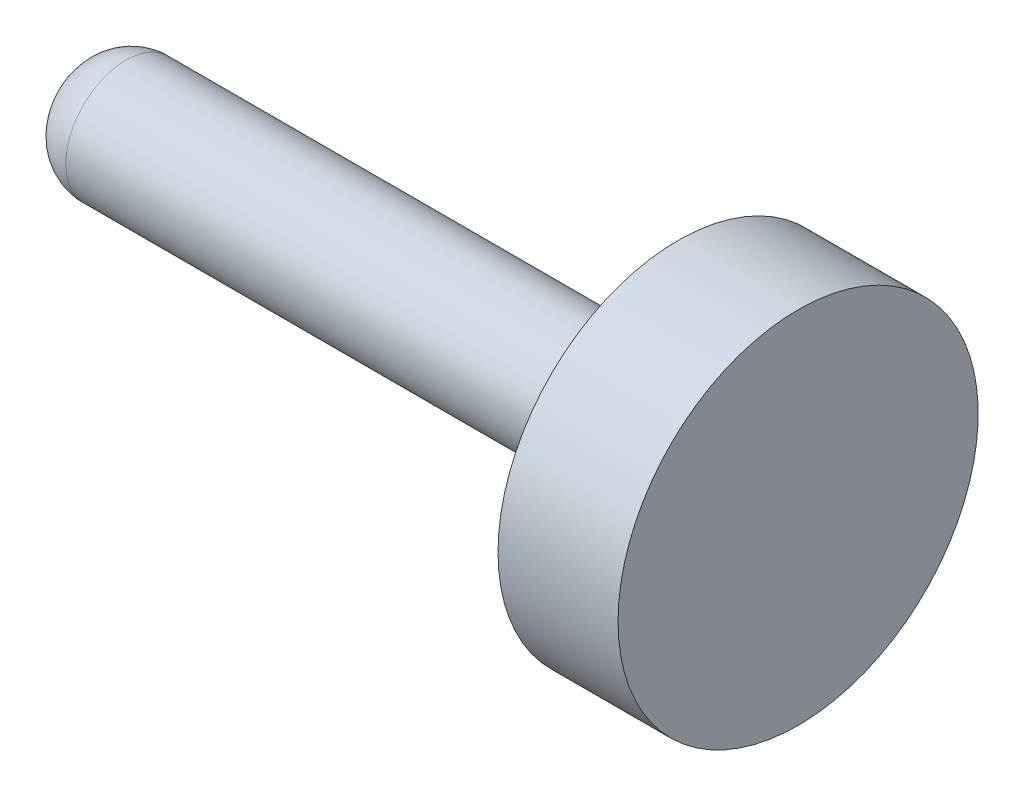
from build123d import *

# Parameters (mm, degrees)
CONG_1_R = 0.8


with BuildPart() as part:
    # Esquisse1 → R_volution1 (revolve)
    with BuildSketch(Plane.XY, mode=Mode.PRIVATE) as r_volution1_sk:
        Polygon((0, 0), (0, 3), (-2, 3), (-2, 1), (-12, 1), (-12, 0), align=None)
    revolve(r_volution1_sk.sketch.rotate(Axis((-12, 0, 0), (1, 0, 0)), 90), axis=Axis((-12, 0, 0), (1, 0, 0)))

    # Cong_1
    cong_1_edges = [part.edges().sort_by_distance(p)[0] for p in [
        (-12, 0, -1),
    ]]
    fillet(cong_1_edges, radius=CONG_1_R)


solid = part.part
